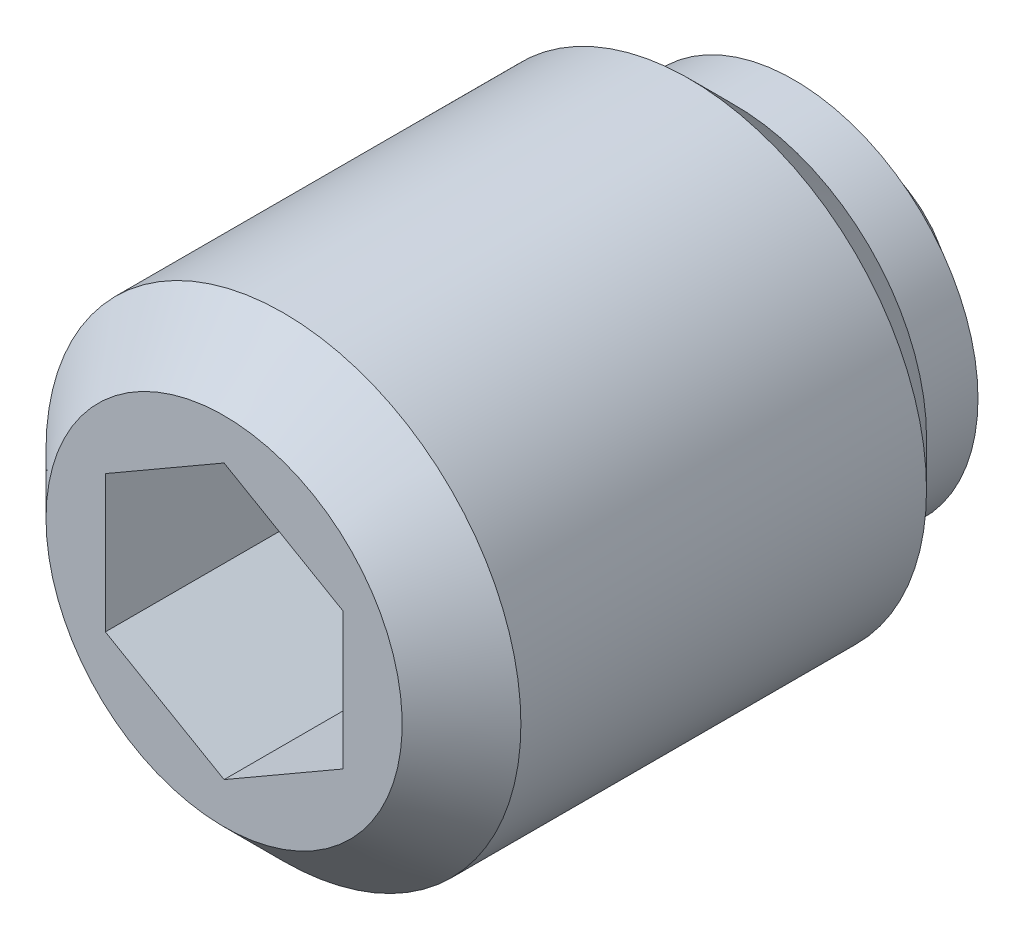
ISO-10303-21;
HEADER;
FILE_DESCRIPTION(('STEP AP214'),'2;1');
FILE_NAME('part.step','',(''),(''),'','','');
FILE_SCHEMA(('AUTOMOTIVE_DESIGN { 1 0 10303 214 1 1 1 1 }'));
ENDSEC;
DATA;
#1=APPLICATION_CONTEXT('core data for automotive mechanical design processes');
#2=APPLICATION_PROTOCOL_DEFINITION('international standard','automotive_design',2000,#1);
#3=PRODUCT_CONTEXT('',#1,'mechanical');
#4=PRODUCT('Part','Part','',(#3));
#5=PRODUCT_RELATED_PRODUCT_CATEGORY('part','',(#4));
#6=PRODUCT_DEFINITION_FORMATION('','',#4);
#7=PRODUCT_DEFINITION_CONTEXT('part definition',#1,'design');
#8=PRODUCT_DEFINITION('design','',#6,#7);
#9=PRODUCT_DEFINITION_SHAPE('','',#8);
#10=(LENGTH_UNIT() NAMED_UNIT(*) SI_UNIT(.MILLI.,.METRE.));
#11=(NAMED_UNIT(*) PLANE_ANGLE_UNIT() SI_UNIT($,.RADIAN.));
#12=(NAMED_UNIT(*) SI_UNIT($,.STERADIAN.) SOLID_ANGLE_UNIT());
#13=UNCERTAINTY_MEASURE_WITH_UNIT(LENGTH_MEASURE(1.E-05),#10,'distance_accuracy_value','');
#14=(GEOMETRIC_REPRESENTATION_CONTEXT(3) GLOBAL_UNCERTAINTY_ASSIGNED_CONTEXT((#13)) GLOBAL_UNIT_ASSIGNED_CONTEXT((#10,
#11,#12)) REPRESENTATION_CONTEXT('',''));
#15=CARTESIAN_POINT('',(0.,0.,0.));
#16=DIRECTION('',(0.,0.,1.));
#17=DIRECTION('',(1.,0.,0.));
#18=AXIS2_PLACEMENT_3D('',#15,#16,#17);
#19=CARTESIAN_POINT('',(0.,3.1,1.6));
#20=DIRECTION('',(0.,0.,1.));
#21=DIRECTION('',(1.,0.,0.));
#22=AXIS2_PLACEMENT_3D('',#19,#20,#21);
#23=PLANE('',#22);
#24=CARTESIAN_POINT('',(0.,0.,1.6));
#25=DIRECTION('',(0.,0.,1.));
#26=DIRECTION('',(1.,0.,0.));
#27=AXIS2_PLACEMENT_3D('',#24,#25,#26);
#28=CIRCLE('',#27,3.1);
#29=CARTESIAN_POINT('',(3.1,0.,1.6));
#30=VERTEX_POINT('',#29);
#31=EDGE_CURVE('E20',#30,#30,#28,.T.);
#32=ORIENTED_EDGE('',*,*,#31,.F.);
#33=EDGE_LOOP('',(#32));
#34=FACE_BOUND('',#33,.T.);
#35=CARTESIAN_POINT('',(2.49799919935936,0.,1.6));
#36=CARTESIAN_POINT('',(2.49799297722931,-0.140313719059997,1.6));
#37=CARTESIAN_POINT('',(2.48613730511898,-0.280729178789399,1.6));
#38=CARTESIAN_POINT('',(2.43900719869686,-0.557692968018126,1.6));
#39=CARTESIAN_POINT('',(2.40370457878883,-0.694236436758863,1.6));
#40=CARTESIAN_POINT('',(2.31068556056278,-0.959403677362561,1.6));
#41=CARTESIAN_POINT('',(2.25297986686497,-1.08803119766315,1.6));
#42=CARTESIAN_POINT('',(2.11680745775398,-1.33373649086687,1.6));
#43=CARTESIAN_POINT('',(2.03834590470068,-1.45081712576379,1.6));
#44=CARTESIAN_POINT('',(1.86287316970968,-1.67015864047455,1.6));
#45=CARTESIAN_POINT('',(1.76586004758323,-1.77241796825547,1.6));
#46=CARTESIAN_POINT('',(1.55603904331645,-1.95920184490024,1.6));
#47=CARTESIAN_POINT('',(1.44323054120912,-2.04372569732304,1.6));
#48=CARTESIAN_POINT('',(1.20502635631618,-2.19263304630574,1.6));
#49=CARTESIAN_POINT('',(1.07963090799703,-2.25701691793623,1.6));
#50=CARTESIAN_POINT('',(0.819810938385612,-2.36381857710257,1.6));
#51=CARTESIAN_POINT('',(0.685386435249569,-2.40623640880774,1.6));
#52=CARTESIAN_POINT('',(0.411323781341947,-2.46790215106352,1.6));
#53=CARTESIAN_POINT('',(0.27168562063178,-2.48715001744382,1.6));
#54=CARTESIAN_POINT('',(-0.00883992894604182,-2.50192927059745,1.6));
#55=CARTESIAN_POINT('',(-0.14972731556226,-2.49746070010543,1.6));
#56=CARTESIAN_POINT('',(-0.428752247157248,-2.46493402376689,1.6));
#57=CARTESIAN_POINT('',(-0.566889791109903,-2.436875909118,1.6));
#58=CARTESIAN_POINT('',(-0.836493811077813,-2.35796657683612,1.6));
#59=CARTESIAN_POINT('',(-0.967960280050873,-2.30711533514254,1.6));
#60=CARTESIAN_POINT('',(-1.22049000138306,-2.1840632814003,1.6));
#61=CARTESIAN_POINT('',(-1.3415532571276,-2.11186247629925,1.6));
#62=CARTESIAN_POINT('',(-1.56983992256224,-1.94816089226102,1.6));
#63=CARTESIAN_POINT('',(-1.67706333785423,-1.85666012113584,1.6));
#64=CARTESIAN_POINT('',(-1.87462663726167,-1.65695601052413,1.6));
#65=CARTESIAN_POINT('',(-1.96496651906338,-1.54875266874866,1.6));
#66=CARTESIAN_POINT('',(-2.12619826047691,-1.31871498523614,1.6));
#67=CARTESIAN_POINT('',(-2.1970901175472,-1.19688064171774,1.6));
#68=CARTESIAN_POINT('',(-2.31741337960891,-0.943039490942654,1.6));
#69=CARTESIAN_POINT('',(-2.36684478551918,-0.811032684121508,1.6));
#70=CARTESIAN_POINT('',(-2.44284393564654,-0.540593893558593,1.6));
#71=CARTESIAN_POINT('',(-2.46941168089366,-0.402161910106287,1.6));
#72=CARTESIAN_POINT('',(-2.4989293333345,-0.122802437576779,1.6));
#73=CARTESIAN_POINT('',(-2.50187924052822,0.0181250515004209,1.6));
#74=CARTESIAN_POINT('',(-2.4840774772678,0.29847502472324,1.6));
#75=CARTESIAN_POINT('',(-2.46332580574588,0.437897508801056,1.6));
#76=CARTESIAN_POINT('',(-2.39870996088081,0.711279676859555,1.6));
#77=CARTESIAN_POINT('',(-2.35484578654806,0.845239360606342,1.6));
#78=CARTESIAN_POINT('',(-2.24525011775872,1.10389318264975,1.6));
#79=CARTESIAN_POINT('',(-2.17951862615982,1.22858732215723,1.6));
#80=CARTESIAN_POINT('',(-2.02805425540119,1.46517035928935,1.6));
#81=CARTESIAN_POINT('',(-1.94232137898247,1.57705925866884,1.6));
#82=CARTESIAN_POINT('',(-1.75328789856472,1.78485568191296,1.6));
#83=CARTESIAN_POINT('',(-1.64998728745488,1.88076319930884,1.6));
#84=CARTESIAN_POINT('',(-1.42875072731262,2.05387429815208,1.6));
#85=CARTESIAN_POINT('',(-1.31081477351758,2.13107787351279,1.6));
#86=CARTESIAN_POINT('',(-1.0636555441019,2.26458939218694,1.6));
#87=CARTESIAN_POINT('',(-0.934432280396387,2.3208973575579,1.6));
#88=CARTESIAN_POINT('',(-0.668366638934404,2.4110193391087,1.6));
#89=CARTESIAN_POINT('',(-0.531524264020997,2.44483336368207,1.6));
#90=CARTESIAN_POINT('',(-0.254104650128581,2.48900765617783,1.6));
#91=CARTESIAN_POINT('',(-0.113527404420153,2.49936788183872,1.6));
#92=CARTESIAN_POINT('',(0.167370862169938,2.49634036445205,1.6));
#93=CARTESIAN_POINT('',(0.307691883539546,2.48295266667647,1.6));
#94=CARTESIAN_POINT('',(0.584094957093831,2.43280935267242,1.6));
#95=CARTESIAN_POINT('',(0.720177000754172,2.39605368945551,1.6));
#96=CARTESIAN_POINT('',(0.984241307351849,2.30021698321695,1.6));
#97=CARTESIAN_POINT('',(1.11222341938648,2.24113552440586,1.6));
#98=CARTESIAN_POINT('',(1.35644714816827,2.10232687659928,1.6));
#99=CARTESIAN_POINT('',(1.47268922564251,2.02260049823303,1.6));
#100=CARTESIAN_POINT('',(1.69012741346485,1.84477469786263,1.6));
#101=CARTESIAN_POINT('',(1.7913250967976,1.7466771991,1.6));
#102=CARTESIAN_POINT('',(1.97584058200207,1.53485639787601,1.6));
#103=CARTESIAN_POINT('',(2.05915393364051,1.42112921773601,1.6));
#104=CARTESIAN_POINT('',(2.20553631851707,1.18125758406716,1.6));
#105=CARTESIAN_POINT('',(2.26859566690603,1.05510722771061,1.6));
#106=CARTESIAN_POINT('',(2.37256784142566,0.794109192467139,1.6));
#107=CARTESIAN_POINT('',(2.4135072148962,0.659272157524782,1.6));
#108=CARTESIAN_POINT('',(2.46116606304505,0.436313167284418,1.6));
#109=CARTESIAN_POINT('',(2.47496125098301,0.349639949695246,1.6));
#110=CARTESIAN_POINT('',(2.49337976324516,0.175324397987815,1.6));
#111=CARTESIAN_POINT('',(2.49800308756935,0.0876820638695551,1.6));
#112=CARTESIAN_POINT('',(2.49799919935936,0.,1.6));
#113=B_SPLINE_CURVE_WITH_KNOTS('',3,(#35,#36,#37,#38,#39,#40,#41,#42,#43,#44,#45,#46,#47,#48,
#49,#50,#51,#52,#53,#54,#55,#56,#57,#58,#59,#60,#61,#62,#63,#64,#65,#66,#67,#68,#69,#70,#71,#72,
#73,#74,#75,#76,#77,#78,#79,#80,#81,#82,#83,#84,#85,#86,#87,#88,#89,#90,#91,#92,#93,#94,#95,#96,
#97,#98,#99,#100,#101,#102,#103,#104,#105,#106,#107,#108,#109,#110,#111,#112),.UNSPECIFIED.,.T.,
.F.,(4,2,2,2,2,2,2,2,2,2,2,2,2,2,2,2,2,2,2,2,2,2,2,2,2,2,2,2,2,2,2,2,2,2,2,2,2,2,4),(0.,
0.420621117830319,0.841748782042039,1.26267547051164,1.68349756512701,2.10436369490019,
2.52524634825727,2.94612116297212,3.36699513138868,3.78786990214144,4.20874391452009,
4.62961808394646,5.05049269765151,5.47136717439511,5.89224148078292,6.31311584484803,
6.73399026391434,7.15486466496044,7.57573904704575,7.99661342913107,8.41748783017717,
8.83836224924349,9.25923661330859,9.68011091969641,10.10098539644,10.5218600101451,
10.9427341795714,11.3636081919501,11.7844829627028,12.2053569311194,12.6262317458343,
13.0471143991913,13.4679805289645,13.8888026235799,14.3097293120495,14.7308569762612,
15.1514780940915,15.4143242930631,15.6771704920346),.UNSPECIFIED.);
#114=CARTESIAN_POINT('',(2.49799919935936,0.,1.6));
#115=VERTEX_POINT('',#114);
#116=EDGE_CURVE('E76',#115,#115,#113,.T.);
#117=ORIENTED_EDGE('',*,*,#116,.F.);
#118=EDGE_LOOP('',(#117));
#119=FACE_BOUND('',#118,.T.);
#120=ADVANCED_FACE('F14',(#34,#119),#23,.F.);
#121=CARTESIAN_POINT('',(0.,0.,8.2));
#122=DIRECTION('',(0.,0.,-1.));
#123=DIRECTION('',(-1.,0.,0.));
#124=AXIS2_PLACEMENT_3D('',#121,#122,#123);
#125=PLANE('',#124);
#126=DIRECTION('',(0.,1.,0.));
#127=VECTOR('',#126,1.);
#128=CARTESIAN_POINT('',(-2.,-1.15470053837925,8.2));
#129=LINE('',#128,#127);
#130=CARTESIAN_POINT('',(-2.,-1.15470053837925,8.2));
#131=VERTEX_POINT('',#130);
#132=CARTESIAN_POINT('',(-2.,1.15470053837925,8.2));
#133=VERTEX_POINT('',#132);
#134=EDGE_CURVE('E123',#131,#133,#129,.T.);
#135=ORIENTED_EDGE('',*,*,#134,.F.);
#136=DIRECTION('',(0.866025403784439,-0.5,0.));
#137=VECTOR('',#136,1.);
#138=CARTESIAN_POINT('',(0.,-2.3094010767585,8.2));
#139=LINE('',#138,#137);
#140=CARTESIAN_POINT('',(0.,-2.3094010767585,8.2));
#141=VERTEX_POINT('',#140);
#142=EDGE_CURVE('E119',#141,#131,#139,.F.);
#143=ORIENTED_EDGE('',*,*,#142,.F.);
#144=DIRECTION('',(-0.866025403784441,-0.5,0.));
#145=VECTOR('',#144,1.);
#146=CARTESIAN_POINT('',(1.,-1.73205080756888,8.2));
#147=LINE('',#146,#145);
#148=CARTESIAN_POINT('',(2.,-1.15470053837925,8.2));
#149=VERTEX_POINT('',#148);
#150=EDGE_CURVE('E85',#149,#141,#147,.T.);
#151=ORIENTED_EDGE('',*,*,#150,.F.);
#152=DIRECTION('',(0.,1.,0.));
#153=VECTOR('',#152,1.);
#154=CARTESIAN_POINT('',(2.,0.,8.2));
#155=LINE('',#154,#153);
#156=CARTESIAN_POINT('',(2.,1.15470053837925,8.2));
#157=VERTEX_POINT('',#156);
#158=EDGE_CURVE('E68',#157,#149,#155,.F.);
#159=ORIENTED_EDGE('',*,*,#158,.F.);
#160=DIRECTION('',(0.866025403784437,-0.5,0.));
#161=VECTOR('',#160,1.);
#162=CARTESIAN_POINT('',(1.,1.73205080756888,8.2));
#163=LINE('',#162,#161);
#164=CARTESIAN_POINT('',(0.,2.3094010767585,8.2));
#165=VERTEX_POINT('',#164);
#166=EDGE_CURVE('E71',#165,#157,#163,.T.);
#167=ORIENTED_EDGE('',*,*,#166,.F.);
#168=DIRECTION('',(0.866025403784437,0.5,0.));
#169=VECTOR('',#168,1.);
#170=CARTESIAN_POINT('',(-2.,1.15470053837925,8.2));
#171=LINE('',#170,#169);
#172=EDGE_CURVE('E74',#133,#165,#171,.T.);
#173=ORIENTED_EDGE('',*,*,#172,.F.);
#174=EDGE_LOOP('',(#135,#143,#151,#159,#167,#173));
#175=FACE_BOUND('',#174,.T.);
#176=ADVANCED_FACE('F73',(#175),#125,.F.);
#177=CARTESIAN_POINT('',(0.,0.,1.6));
#178=DIRECTION('',(0.,0.,1.));
#179=DIRECTION('',(1.,0.,0.));
#180=AXIS2_PLACEMENT_3D('',#177,#178,#179);
#181=CYLINDRICAL_SURFACE('',#180,3.1);
#182=CARTESIAN_POINT('',(0.,0.,2.6));
#183=DIRECTION('',(0.,0.,1.));
#184=DIRECTION('',(1.,0.,0.));
#185=AXIS2_PLACEMENT_3D('',#182,#183,#184);
#186=CIRCLE('',#185,3.1);
#187=CARTESIAN_POINT('',(3.1,0.,2.6));
#188=VERTEX_POINT('',#187);
#189=EDGE_CURVE('E88',#188,#188,#186,.F.);
#190=ORIENTED_EDGE('',*,*,#189,.T.);
#191=EDGE_LOOP('',(#190));
#192=FACE_BOUND('',#191,.T.);
#193=ORIENTED_EDGE('',*,*,#31,.T.);
#194=EDGE_LOOP('',(#193));
#195=FACE_BOUND('',#194,.T.);
#196=ADVANCED_FACE('F264',(#192,#195),#181,.T.);
#197=CARTESIAN_POINT('',(-2.,-1.15470053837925,8.2));
#198=DIRECTION('',(1.,0.,0.));
#199=DIRECTION('',(0.,0.,-1.));
#200=AXIS2_PLACEMENT_3D('',#197,#198,#199);
#201=PLANE('',#200);
#202=ORIENTED_EDGE('',*,*,#134,.T.);
#203=DIRECTION('',(0.,0.,-1.));
#204=VECTOR('',#203,1.);
#205=CARTESIAN_POINT('',(-2.,1.15470053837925,8.2));
#206=LINE('',#205,#204);
#207=CARTESIAN_POINT('',(-2.,1.15470053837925,11.2));
#208=VERTEX_POINT('',#207);
#209=EDGE_CURVE('E84',#208,#133,#206,.T.);
#210=ORIENTED_EDGE('',*,*,#209,.F.);
#211=DIRECTION('',(0.,1.,0.));
#212=VECTOR('',#211,1.);
#213=CARTESIAN_POINT('',(-2.,0.,11.2));
#214=LINE('',#213,#212);
#215=CARTESIAN_POINT('',(-2.,-1.15470053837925,11.2));
#216=VERTEX_POINT('',#215);
#217=EDGE_CURVE('E91',#208,#216,#214,.F.);
#218=ORIENTED_EDGE('',*,*,#217,.T.);
#219=DIRECTION('',(0.,0.,-1.));
#220=VECTOR('',#219,1.);
#221=CARTESIAN_POINT('',(-2.,-1.15470053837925,8.2));
#222=LINE('',#221,#220);
#223=EDGE_CURVE('E122',#131,#216,#222,.F.);
#224=ORIENTED_EDGE('',*,*,#223,.F.);
#225=EDGE_LOOP('',(#202,#210,#218,#224));
#226=FACE_BOUND('',#225,.T.);
#227=ADVANCED_FACE('F145',(#226),#201,.T.);
#228=CARTESIAN_POINT('',(0.,-2.3094010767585,8.2));
#229=DIRECTION('',(0.5,0.866025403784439,0.));
#230=DIRECTION('',(0.866025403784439,-0.5,0.));
#231=AXIS2_PLACEMENT_3D('',#228,#229,#230);
#232=PLANE('',#231);
#233=ORIENTED_EDGE('',*,*,#142,.T.);
#234=ORIENTED_EDGE('',*,*,#223,.T.);
#235=DIRECTION('',(0.866025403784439,-0.5,0.));
#236=VECTOR('',#235,1.);
#237=CARTESIAN_POINT('',(-2.,-1.15470053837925,11.2));
#238=LINE('',#237,#236);
#239=CARTESIAN_POINT('',(0.,-2.3094010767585,11.2));
#240=VERTEX_POINT('',#239);
#241=EDGE_CURVE('E116',#216,#240,#238,.T.);
#242=ORIENTED_EDGE('',*,*,#241,.T.);
#243=DIRECTION('',(0.,0.,-1.));
#244=VECTOR('',#243,1.);
#245=CARTESIAN_POINT('',(0.,-2.3094010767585,8.2));
#246=LINE('',#245,#244);
#247=EDGE_CURVE('E126',#141,#240,#246,.F.);
#248=ORIENTED_EDGE('',*,*,#247,.F.);
#249=EDGE_LOOP('',(#233,#234,#242,#248));
#250=FACE_BOUND('',#249,.T.);
#251=ADVANCED_FACE('F147',(#250),#232,.T.);
#252=CARTESIAN_POINT('',(2.,-1.15470053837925,8.2));
#253=DIRECTION('',(-0.5,0.866025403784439,0.));
#254=DIRECTION('',(0.866025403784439,0.5,0.));
#255=AXIS2_PLACEMENT_3D('',#252,#253,#254);
#256=PLANE('',#255);
#257=ORIENTED_EDGE('',*,*,#150,.T.);
#258=ORIENTED_EDGE('',*,*,#247,.T.);
#259=DIRECTION('',(0.866025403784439,0.5,0.));
#260=VECTOR('',#259,1.);
#261=CARTESIAN_POINT('',(0.,-2.3094010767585,11.2));
#262=LINE('',#261,#260);
#263=CARTESIAN_POINT('',(2.,-1.15470053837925,11.2));
#264=VERTEX_POINT('',#263);
#265=EDGE_CURVE('E114',#240,#264,#262,.T.);
#266=ORIENTED_EDGE('',*,*,#265,.T.);
#267=DIRECTION('',(0.,0.,1.));
#268=VECTOR('',#267,1.);
#269=CARTESIAN_POINT('',(2.,-1.15470053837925,8.2));
#270=LINE('',#269,#268);
#271=EDGE_CURVE('E133',#149,#264,#270,.T.);
#272=ORIENTED_EDGE('',*,*,#271,.F.);
#273=EDGE_LOOP('',(#257,#258,#266,#272));
#274=FACE_BOUND('',#273,.T.);
#275=ADVANCED_FACE('F150',(#274),#256,.T.);
#276=CARTESIAN_POINT('',(2.,1.15470053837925,8.2));
#277=DIRECTION('',(-1.,0.,0.));
#278=DIRECTION('',(0.,0.,1.));
#279=AXIS2_PLACEMENT_3D('',#276,#277,#278);
#280=PLANE('',#279);
#281=ORIENTED_EDGE('',*,*,#158,.T.);
#282=ORIENTED_EDGE('',*,*,#271,.T.);
#283=DIRECTION('',(0.,1.,0.));
#284=VECTOR('',#283,1.);
#285=CARTESIAN_POINT('',(2.,0.,11.2));
#286=LINE('',#285,#284);
#287=CARTESIAN_POINT('',(2.,1.15470053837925,11.2));
#288=VERTEX_POINT('',#287);
#289=EDGE_CURVE('E107',#264,#288,#286,.T.);
#290=ORIENTED_EDGE('',*,*,#289,.T.);
#291=DIRECTION('',(0.,0.,-1.));
#292=VECTOR('',#291,1.);
#293=CARTESIAN_POINT('',(2.,1.15470053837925,8.2));
#294=LINE('',#293,#292);
#295=EDGE_CURVE('E92',#157,#288,#294,.F.);
#296=ORIENTED_EDGE('',*,*,#295,.F.);
#297=EDGE_LOOP('',(#281,#282,#290,#296));
#298=FACE_BOUND('',#297,.T.);
#299=ADVANCED_FACE('F152',(#298),#280,.T.);
#300=CARTESIAN_POINT('',(0.,2.3094010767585,8.2));
#301=DIRECTION('',(-0.5,-0.866025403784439,0.));
#302=DIRECTION('',(-0.866025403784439,0.5,0.));
#303=AXIS2_PLACEMENT_3D('',#300,#301,#302);
#304=PLANE('',#303);
#305=ORIENTED_EDGE('',*,*,#166,.T.);
#306=ORIENTED_EDGE('',*,*,#295,.T.);
#307=DIRECTION('',(-0.866025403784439,0.5,0.));
#308=VECTOR('',#307,1.);
#309=CARTESIAN_POINT('',(2.,1.15470053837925,11.2));
#310=LINE('',#309,#308);
#311=CARTESIAN_POINT('',(0.,2.3094010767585,11.2));
#312=VERTEX_POINT('',#311);
#313=EDGE_CURVE('E35',#288,#312,#310,.T.);
#314=ORIENTED_EDGE('',*,*,#313,.T.);
#315=DIRECTION('',(0.,0.,-1.));
#316=VECTOR('',#315,1.);
#317=CARTESIAN_POINT('',(0.,2.3094010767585,8.2));
#318=LINE('',#317,#316);
#319=EDGE_CURVE('E82',#165,#312,#318,.F.);
#320=ORIENTED_EDGE('',*,*,#319,.F.);
#321=EDGE_LOOP('',(#305,#306,#314,#320));
#322=FACE_BOUND('',#321,.T.);
#323=ADVANCED_FACE('F87',(#322),#304,.T.);
#324=CARTESIAN_POINT('',(-2.,1.15470053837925,8.2));
#325=DIRECTION('',(0.5,-0.866025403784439,0.));
#326=DIRECTION('',(-0.866025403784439,-0.5,0.));
#327=AXIS2_PLACEMENT_3D('',#324,#325,#326);
#328=PLANE('',#327);
#329=ORIENTED_EDGE('',*,*,#172,.T.);
#330=ORIENTED_EDGE('',*,*,#319,.T.);
#331=DIRECTION('',(-0.866025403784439,-0.5,0.));
#332=VECTOR('',#331,1.);
#333=CARTESIAN_POINT('',(0.,2.3094010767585,11.2));
#334=LINE('',#333,#332);
#335=EDGE_CURVE('E102',#312,#208,#334,.T.);
#336=ORIENTED_EDGE('',*,*,#335,.T.);
#337=ORIENTED_EDGE('',*,*,#209,.T.);
#338=EDGE_LOOP('',(#329,#330,#336,#337));
#339=FACE_BOUND('',#338,.T.);
#340=ADVANCED_FACE('F80',(#339),#328,.T.);
#341=CARTESIAN_POINT('',(0.,3.233,2.6));
#342=DIRECTION('',(0.,0.,1.));
#343=DIRECTION('',(1.,0.,0.));
#344=AXIS2_PLACEMENT_3D('',#341,#342,#343);
#345=PLANE('',#344);
#346=CARTESIAN_POINT('',(0.,0.,2.59999999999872));
#347=DIRECTION('',(0.,0.,1.));
#348=DIRECTION('',(1.,0.,0.));
#349=AXIS2_PLACEMENT_3D('',#346,#347,#348);
#350=CIRCLE('',#349,3.23299999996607);
#351=CARTESIAN_POINT('',(3.23299999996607,0.,2.59999999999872));
#352=VERTEX_POINT('',#351);
#353=EDGE_CURVE('E100',#352,#352,#350,.T.);
#354=ORIENTED_EDGE('',*,*,#353,.F.);
#355=EDGE_LOOP('',(#354));
#356=FACE_BOUND('',#355,.T.);
#357=ORIENTED_EDGE('',*,*,#189,.F.);
#358=EDGE_LOOP('',(#357));
#359=FACE_BOUND('',#358,.T.);
#360=ADVANCED_FACE('F183',(#356,#359),#345,.F.);
#361=CARTESIAN_POINT('',(0.,0.,11.2));
#362=DIRECTION('',(0.,0.,-1.));
#363=DIRECTION('',(-1.,0.,0.));
#364=AXIS2_PLACEMENT_3D('',#361,#362,#363);
#365=PLANE('',#364);
#366=ORIENTED_EDGE('',*,*,#313,.F.);
#367=ORIENTED_EDGE('',*,*,#289,.F.);
#368=ORIENTED_EDGE('',*,*,#265,.F.);
#369=ORIENTED_EDGE('',*,*,#241,.F.);
#370=ORIENTED_EDGE('',*,*,#217,.F.);
#371=ORIENTED_EDGE('',*,*,#335,.F.);
#372=EDGE_LOOP('',(#366,#367,#368,#369,#370,#371));
#373=FACE_BOUND('',#372,.T.);
#374=CARTESIAN_POINT('',(0.,0.,11.1999999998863));
#375=DIRECTION('',(0.,0.,-1.));
#376=DIRECTION('',(-1.,0.,0.));
#377=AXIS2_PLACEMENT_3D('',#374,#375,#376);
#378=CIRCLE('',#377,2.99999999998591);
#379=CARTESIAN_POINT('',(-2.99999999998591,0.,11.1999999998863));
#380=VERTEX_POINT('',#379);
#381=EDGE_CURVE('E97',#380,#380,#378,.T.);
#382=ORIENTED_EDGE('',*,*,#381,.F.);
#383=EDGE_LOOP('',(#382));
#384=FACE_BOUND('',#383,.T.);
#385=ADVANCED_FACE('F139',(#373,#384),#365,.F.);
#386=CARTESIAN_POINT('',(0.,0.,3.36700000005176));
#387=DIRECTION('',(0.,0.,1.));
#388=DIRECTION('',(1.,0.,0.));
#389=AXIS2_PLACEMENT_3D('',#386,#387,#388);
#390=CONICAL_SURFACE('',#389,4.0000000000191,0.785398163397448);
#391=CARTESIAN_POINT('',(0.,0.,3.367));
#392=DIRECTION('',(0.,0.,1.));
#393=DIRECTION('',(1.,0.,0.));
#394=AXIS2_PLACEMENT_3D('',#391,#392,#393);
#395=CIRCLE('',#394,4.);
#396=CARTESIAN_POINT('',(4.,0.,3.367));
#397=VERTEX_POINT('',#396);
#398=EDGE_CURVE('E26',#397,#397,#395,.T.);
#399=ORIENTED_EDGE('',*,*,#398,.F.);
#400=EDGE_LOOP('',(#399));
#401=FACE_BOUND('',#400,.T.);
#402=ORIENTED_EDGE('',*,*,#353,.T.);
#403=EDGE_LOOP('',(#402));
#404=FACE_BOUND('',#403,.T.);
#405=ADVANCED_FACE('F171',(#401,#404),#390,.T.);
#406=CARTESIAN_POINT('',(0.,0.,10.2000000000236));
#407=DIRECTION('',(0.,0.,-1.));
#408=DIRECTION('',(-1.,0.,0.));
#409=AXIS2_PLACEMENT_3D('',#406,#407,#408);
#410=CONICAL_SURFACE('',#409,3.99999999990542,0.785398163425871);
#411=ORIENTED_EDGE('',*,*,#381,.T.);
#412=EDGE_LOOP('',(#411));
#413=FACE_BOUND('',#412,.T.);
#414=CARTESIAN_POINT('',(0.,0.,10.2));
#415=DIRECTION('',(0.,0.,1.));
#416=DIRECTION('',(1.,0.,0.));
#417=AXIS2_PLACEMENT_3D('',#414,#415,#416);
#418=CIRCLE('',#417,4.);
#419=CARTESIAN_POINT('',(4.,0.,10.2));
#420=VERTEX_POINT('',#419);
#421=EDGE_CURVE('E9',#420,#420,#418,.F.);
#422=ORIENTED_EDGE('',*,*,#421,.F.);
#423=EDGE_LOOP('',(#422));
#424=FACE_BOUND('',#423,.T.);
#425=ADVANCED_FACE('F163',(#413,#424),#410,.T.);
#426=CARTESIAN_POINT('',(0.,0.,1.6));
#427=DIRECTION('',(0.,0.,1.));
#428=DIRECTION('',(1.,0.,0.));
#429=AXIS2_PLACEMENT_3D('',#426,#427,#428);
#430=CYLINDRICAL_SURFACE('',#429,4.);
#431=ORIENTED_EDGE('',*,*,#421,.T.);
#432=EDGE_LOOP('',(#431));
#433=FACE_BOUND('',#432,.T.);
#434=ORIENTED_EDGE('',*,*,#398,.T.);
#435=EDGE_LOOP('',(#434));
#436=FACE_BOUND('',#435,.T.);
#437=ADVANCED_FACE('F161',(#433,#436),#430,.T.);
#438=CARTESIAN_POINT('',(0.,0.,2.75));
#439=DIRECTION('',(-1.,0.,0.));
#440=DIRECTION('',(0.,0.,1.));
#441=AXIS2_PLACEMENT_3D('',#438,#439,#440);
#442=SPHERICAL_SURFACE('',#441,2.75);
#443=ORIENTED_EDGE('',*,*,#116,.T.);
#444=EDGE_LOOP('',(#443));
#445=FACE_BOUND('',#444,.T.);
#446=ADVANCED_FACE('F16',(#445),#442,.T.);
#447=CLOSED_SHELL('',(#120,#176,#196,#227,#251,#275,#299,#323,#340,#360,#385,#405,#425,#437,#446));
#448=MANIFOLD_SOLID_BREP('B1',#447);
#449=ADVANCED_BREP_SHAPE_REPRESENTATION('',(#18,#448),#14);
#450=SHAPE_DEFINITION_REPRESENTATION(#9,#449);
ENDSEC;
END-ISO-10303-21;
